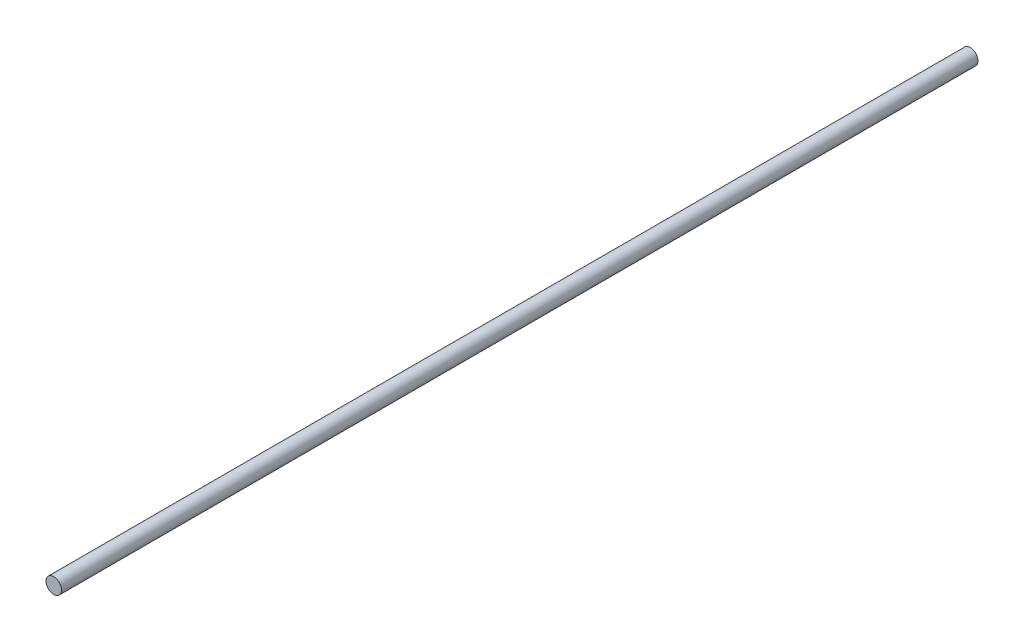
ISO-10303-21;
HEADER;
FILE_DESCRIPTION(('STEP AP214'),'2;1');
FILE_NAME('part.step','',(''),(''),'','','');
FILE_SCHEMA(('AUTOMOTIVE_DESIGN { 1 0 10303 214 1 1 1 1 }'));
ENDSEC;
DATA;
#1=APPLICATION_CONTEXT('core data for automotive mechanical design processes');
#2=APPLICATION_PROTOCOL_DEFINITION('international standard','automotive_design',2000,#1);
#3=PRODUCT_CONTEXT('',#1,'mechanical');
#4=PRODUCT('Part','Part','',(#3));
#5=PRODUCT_RELATED_PRODUCT_CATEGORY('part','',(#4));
#6=PRODUCT_DEFINITION_FORMATION('','',#4);
#7=PRODUCT_DEFINITION_CONTEXT('part definition',#1,'design');
#8=PRODUCT_DEFINITION('design','',#6,#7);
#9=PRODUCT_DEFINITION_SHAPE('','',#8);
#10=(LENGTH_UNIT() NAMED_UNIT(*) SI_UNIT(.MILLI.,.METRE.));
#11=(NAMED_UNIT(*) PLANE_ANGLE_UNIT() SI_UNIT($,.RADIAN.));
#12=(NAMED_UNIT(*) SI_UNIT($,.STERADIAN.) SOLID_ANGLE_UNIT());
#13=UNCERTAINTY_MEASURE_WITH_UNIT(LENGTH_MEASURE(1.E-05),#10,'distance_accuracy_value','');
#14=(GEOMETRIC_REPRESENTATION_CONTEXT(3) GLOBAL_UNCERTAINTY_ASSIGNED_CONTEXT((#13)) GLOBAL_UNIT_ASSIGNED_CONTEXT((#10,
#11,#12)) REPRESENTATION_CONTEXT('',''));
#15=CARTESIAN_POINT('',(0.,0.,0.));
#16=DIRECTION('',(0.,0.,1.));
#17=DIRECTION('',(1.,0.,0.));
#18=AXIS2_PLACEMENT_3D('',#15,#16,#17);
#19=CARTESIAN_POINT('',(0.,0.,-3550.));
#20=DIRECTION('',(0.,0.,1.));
#21=DIRECTION('',(1.,0.,0.));
#22=AXIS2_PLACEMENT_3D('',#19,#20,#21);
#23=CYLINDRICAL_SURFACE('',#22,30.);
#24=CARTESIAN_POINT('',(0.,0.,-3550.));
#25=DIRECTION('',(0.,0.,1.));
#26=DIRECTION('',(1.,0.,0.));
#27=AXIS2_PLACEMENT_3D('',#24,#25,#26);
#28=CIRCLE('',#27,30.);
#29=CARTESIAN_POINT('',(30.,0.,-3550.));
#30=VERTEX_POINT('',#29);
#31=EDGE_CURVE('E10',#30,#30,#28,.T.);
#32=ORIENTED_EDGE('',*,*,#31,.T.);
#33=EDGE_LOOP('',(#32));
#34=FACE_BOUND('',#33,.T.);
#35=CARTESIAN_POINT('',(0.,0.,0.));
#36=DIRECTION('',(0.,0.,1.));
#37=DIRECTION('',(1.,0.,0.));
#38=AXIS2_PLACEMENT_3D('',#35,#36,#37);
#39=CIRCLE('',#38,30.);
#40=CARTESIAN_POINT('',(30.,0.,0.));
#41=VERTEX_POINT('',#40);
#42=EDGE_CURVE('E40',#41,#41,#39,.T.);
#43=ORIENTED_EDGE('',*,*,#42,.F.);
#44=EDGE_LOOP('',(#43));
#45=FACE_BOUND('',#44,.T.);
#46=ADVANCED_FACE('F37',(#34,#45),#23,.T.);
#47=CARTESIAN_POINT('',(0.,0.,-3550.));
#48=DIRECTION('',(0.,0.,1.));
#49=DIRECTION('',(1.,0.,0.));
#50=AXIS2_PLACEMENT_3D('',#47,#48,#49);
#51=PLANE('',#50);
#52=ORIENTED_EDGE('',*,*,#31,.F.);
#53=EDGE_LOOP('',(#52));
#54=FACE_BOUND('',#53,.T.);
#55=ADVANCED_FACE('F54',(#54),#51,.F.);
#56=CARTESIAN_POINT('',(0.,0.,0.));
#57=DIRECTION('',(0.,0.,1.));
#58=DIRECTION('',(1.,0.,0.));
#59=AXIS2_PLACEMENT_3D('',#56,#57,#58);
#60=PLANE('',#59);
#61=ORIENTED_EDGE('',*,*,#42,.T.);
#62=EDGE_LOOP('',(#61));
#63=FACE_BOUND('',#62,.T.);
#64=ADVANCED_FACE('F51',(#63),#60,.T.);
#65=CLOSED_SHELL('',(#46,#55,#64));
#66=MANIFOLD_SOLID_BREP('B2',#65);
#67=ADVANCED_BREP_SHAPE_REPRESENTATION('',(#18,#66),#14);
#68=SHAPE_DEFINITION_REPRESENTATION(#9,#67);
ENDSEC;
END-ISO-10303-21;
